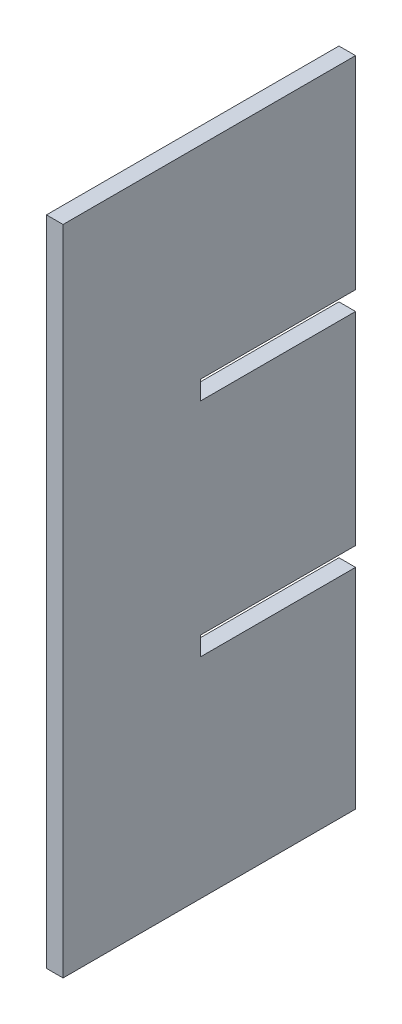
ISO-10303-21;
HEADER;
FILE_DESCRIPTION(('STEP AP214'),'2;1');
FILE_NAME('part.step','',(''),(''),'','','');
FILE_SCHEMA(('AUTOMOTIVE_DESIGN { 1 0 10303 214 1 1 1 1 }'));
ENDSEC;
DATA;
#1=APPLICATION_CONTEXT('core data for automotive mechanical design processes');
#2=APPLICATION_PROTOCOL_DEFINITION('international standard','automotive_design',2000,#1);
#3=PRODUCT_CONTEXT('',#1,'mechanical');
#4=PRODUCT('Part','Part','',(#3));
#5=PRODUCT_RELATED_PRODUCT_CATEGORY('part','',(#4));
#6=PRODUCT_DEFINITION_FORMATION('','',#4);
#7=PRODUCT_DEFINITION_CONTEXT('part definition',#1,'design');
#8=PRODUCT_DEFINITION('design','',#6,#7);
#9=PRODUCT_DEFINITION_SHAPE('','',#8);
#10=(LENGTH_UNIT() NAMED_UNIT(*) SI_UNIT(.MILLI.,.METRE.));
#11=(NAMED_UNIT(*) PLANE_ANGLE_UNIT() SI_UNIT($,.RADIAN.));
#12=(NAMED_UNIT(*) SI_UNIT($,.STERADIAN.) SOLID_ANGLE_UNIT());
#13=UNCERTAINTY_MEASURE_WITH_UNIT(LENGTH_MEASURE(1.E-05),#10,'distance_accuracy_value','');
#14=(GEOMETRIC_REPRESENTATION_CONTEXT(3) GLOBAL_UNCERTAINTY_ASSIGNED_CONTEXT((#13)) GLOBAL_UNIT_ASSIGNED_CONTEXT((#10,
#11,#12)) REPRESENTATION_CONTEXT('',''));
#15=CARTESIAN_POINT('',(0.,0.,0.));
#16=DIRECTION('',(0.,0.,1.));
#17=DIRECTION('',(1.,0.,0.));
#18=AXIS2_PLACEMENT_3D('',#15,#16,#17);
#19=CARTESIAN_POINT('',(0.,0.,0.));
#20=DIRECTION('',(0.,0.,-1.));
#21=DIRECTION('',(-1.,0.,0.));
#22=AXIS2_PLACEMENT_3D('',#19,#20,#21);
#23=PLANE('',#22);
#24=DIRECTION('',(1.,0.,0.));
#25=VECTOR('',#24,1.);
#26=CARTESIAN_POINT('',(-32.352836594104,19.15,0.));
#27=LINE('',#26,#25);
#28=CARTESIAN_POINT('',(-18.25,19.15,0.));
#29=VERTEX_POINT('',#28);
#30=CARTESIAN_POINT('',(-16.75,19.15,0.));
#31=VERTEX_POINT('',#30);
#32=EDGE_CURVE('E135',#29,#31,#27,.T.);
#33=ORIENTED_EDGE('',*,*,#32,.T.);
#34=DIRECTION('',(0.,1.,0.));
#35=VECTOR('',#34,1.);
#36=CARTESIAN_POINT('',(-16.75,-39.75,0.));
#37=LINE('',#36,#35);
#38=CARTESIAN_POINT('',(-16.75,0.849999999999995,0.));
#39=VERTEX_POINT('',#38);
#40=EDGE_CURVE('E132',#39,#31,#37,.T.);
#41=ORIENTED_EDGE('',*,*,#40,.F.);
#42=DIRECTION('',(1.,0.,0.));
#43=VECTOR('',#42,1.);
#44=CARTESIAN_POINT('',(-32.352836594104,0.849999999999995,0.));
#45=LINE('',#44,#43);
#46=CARTESIAN_POINT('',(-18.25,0.849999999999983,0.));
#47=VERTEX_POINT('',#46);
#48=EDGE_CURVE('E189',#47,#39,#45,.T.);
#49=ORIENTED_EDGE('',*,*,#48,.F.);
#50=DIRECTION('',(0.,-1.,0.));
#51=VECTOR('',#50,1.);
#52=CARTESIAN_POINT('',(-18.25,-39.75,0.));
#53=LINE('',#52,#51);
#54=EDGE_CURVE('E47',#29,#47,#53,.T.);
#55=ORIENTED_EDGE('',*,*,#54,.F.);
#56=EDGE_LOOP('',(#33,#41,#49,#55));
#57=FACE_BOUND('',#56,.T.);
#58=ADVANCED_FACE('F32',(#57),#23,.T.);
#59=DIRECTION('',(1.,0.,0.));
#60=VECTOR('',#59,1.);
#61=CARTESIAN_POINT('',(-32.352836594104,-0.850000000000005,0.));
#62=LINE('',#61,#60);
#63=CARTESIAN_POINT('',(-18.25,-0.850000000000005,0.));
#64=VERTEX_POINT('',#63);
#65=CARTESIAN_POINT('',(-16.75,-0.850000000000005,0.));
#66=VERTEX_POINT('',#65);
#67=EDGE_CURVE('E176',#64,#66,#62,.T.);
#68=ORIENTED_EDGE('',*,*,#67,.T.);
#69=CARTESIAN_POINT('',(-16.75,-19.15,0.));
#70=VERTEX_POINT('',#69);
#71=EDGE_CURVE('E159',#70,#66,#37,.T.);
#72=ORIENTED_EDGE('',*,*,#71,.F.);
#73=DIRECTION('',(1.,0.,0.));
#74=VECTOR('',#73,1.);
#75=CARTESIAN_POINT('',(-32.352836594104,-19.15,0.));
#76=LINE('',#75,#74);
#77=CARTESIAN_POINT('',(-18.25,-19.15,0.));
#78=VERTEX_POINT('',#77);
#79=EDGE_CURVE('E175',#78,#70,#76,.T.);
#80=ORIENTED_EDGE('',*,*,#79,.F.);
#81=EDGE_CURVE('E54',#64,#78,#53,.T.);
#82=ORIENTED_EDGE('',*,*,#81,.F.);
#83=EDGE_LOOP('',(#68,#72,#80,#82));
#84=FACE_BOUND('',#83,.T.);
#85=ADVANCED_FACE('F174',(#84),#23,.T.);
#86=DIRECTION('',(1.,0.,0.));
#87=VECTOR('',#86,1.);
#88=CARTESIAN_POINT('',(-32.352836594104,-20.85,0.));
#89=LINE('',#88,#87);
#90=CARTESIAN_POINT('',(-18.25,-20.85,0.));
#91=VERTEX_POINT('',#90);
#92=CARTESIAN_POINT('',(-16.75,-20.85,0.));
#93=VERTEX_POINT('',#92);
#94=EDGE_CURVE('E196',#91,#93,#89,.T.);
#95=ORIENTED_EDGE('',*,*,#94,.T.);
#96=CARTESIAN_POINT('',(-16.75,-39.75,0.));
#97=VERTEX_POINT('',#96);
#98=EDGE_CURVE('E157',#97,#93,#37,.T.);
#99=ORIENTED_EDGE('',*,*,#98,.F.);
#100=DIRECTION('',(1.,0.,0.));
#101=VECTOR('',#100,1.);
#102=CARTESIAN_POINT('',(-18.25,-39.75,0.));
#103=LINE('',#102,#101);
#104=CARTESIAN_POINT('',(-18.25,-39.75,0.));
#105=VERTEX_POINT('',#104);
#106=EDGE_CURVE('E154',#105,#97,#103,.T.);
#107=ORIENTED_EDGE('',*,*,#106,.F.);
#108=EDGE_CURVE('E155',#91,#105,#53,.T.);
#109=ORIENTED_EDGE('',*,*,#108,.F.);
#110=EDGE_LOOP('',(#95,#99,#107,#109));
#111=FACE_BOUND('',#110,.T.);
#112=ADVANCED_FACE('F220',(#111),#23,.T.);
#113=CARTESIAN_POINT('',(-18.25,-39.75,26.4));
#114=DIRECTION('',(1.,0.,0.));
#115=DIRECTION('',(0.,0.,-1.));
#116=AXIS2_PLACEMENT_3D('',#113,#114,#115);
#117=PLANE('',#116);
#118=DIRECTION('',(0.,-1.,0.));
#119=VECTOR('',#118,1.);
#120=CARTESIAN_POINT('',(-18.25,-39.75,26.4));
#121=LINE('',#120,#119);
#122=CARTESIAN_POINT('',(-18.25,19.15,26.4));
#123=VERTEX_POINT('',#122);
#124=CARTESIAN_POINT('',(-18.25,-39.75,26.4));
#125=VERTEX_POINT('',#124);
#126=EDGE_CURVE('E149',#123,#125,#121,.T.);
#127=ORIENTED_EDGE('',*,*,#126,.F.);
#128=DIRECTION('',(0.,0.,1.));
#129=VECTOR('',#128,1.);
#130=CARTESIAN_POINT('',(-18.25,19.15,0.));
#131=LINE('',#130,#129);
#132=EDGE_CURVE('E140',#29,#123,#131,.T.);
#133=ORIENTED_EDGE('',*,*,#132,.F.);
#134=ORIENTED_EDGE('',*,*,#54,.T.);
#135=DIRECTION('',(0.,0.,-1.));
#136=VECTOR('',#135,1.);
#137=CARTESIAN_POINT('',(-18.25,0.849999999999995,0.));
#138=LINE('',#137,#136);
#139=CARTESIAN_POINT('',(-18.25,0.849999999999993,14.));
#140=VERTEX_POINT('',#139);
#141=EDGE_CURVE('E191',#140,#47,#138,.T.);
#142=ORIENTED_EDGE('',*,*,#141,.F.);
#143=DIRECTION('',(0.,1.,0.));
#144=VECTOR('',#143,1.);
#145=CARTESIAN_POINT('',(-18.25,-0.850000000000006,14.));
#146=LINE('',#145,#144);
#147=CARTESIAN_POINT('',(-18.25,-0.850000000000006,14.));
#148=VERTEX_POINT('',#147);
#149=EDGE_CURVE('E178',#148,#140,#146,.T.);
#150=ORIENTED_EDGE('',*,*,#149,.F.);
#151=DIRECTION('',(0.,0.,1.));
#152=VECTOR('',#151,1.);
#153=CARTESIAN_POINT('',(-18.25,-0.850000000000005,0.));
#154=LINE('',#153,#152);
#155=EDGE_CURVE('E181',#64,#148,#154,.T.);
#156=ORIENTED_EDGE('',*,*,#155,.F.);
#157=ORIENTED_EDGE('',*,*,#81,.T.);
#158=DIRECTION('',(0.,0.,-1.));
#159=VECTOR('',#158,1.);
#160=CARTESIAN_POINT('',(-18.25,-19.15,0.));
#161=LINE('',#160,#159);
#162=CARTESIAN_POINT('',(-18.25,-19.15,14.));
#163=VERTEX_POINT('',#162);
#164=EDGE_CURVE('E198',#163,#78,#161,.T.);
#165=ORIENTED_EDGE('',*,*,#164,.F.);
#166=DIRECTION('',(0.,1.,0.));
#167=VECTOR('',#166,1.);
#168=CARTESIAN_POINT('',(-18.25,-20.85,14.));
#169=LINE('',#168,#167);
#170=CARTESIAN_POINT('',(-18.25,-20.85,14.));
#171=VERTEX_POINT('',#170);
#172=EDGE_CURVE('E193',#171,#163,#169,.T.);
#173=ORIENTED_EDGE('',*,*,#172,.F.);
#174=DIRECTION('',(0.,0.,1.));
#175=VECTOR('',#174,1.);
#176=CARTESIAN_POINT('',(-18.25,-20.85,0.));
#177=LINE('',#176,#175);
#178=EDGE_CURVE('E195',#91,#171,#177,.T.);
#179=ORIENTED_EDGE('',*,*,#178,.F.);
#180=ORIENTED_EDGE('',*,*,#108,.T.);
#181=DIRECTION('',(0.,0.,-1.));
#182=VECTOR('',#181,1.);
#183=CARTESIAN_POINT('',(-18.25,-39.75,26.4));
#184=LINE('',#183,#182);
#185=EDGE_CURVE('E11',#125,#105,#184,.T.);
#186=ORIENTED_EDGE('',*,*,#185,.F.);
#187=EDGE_LOOP('',(#127,#133,#134,#142,#150,#156,#157,#165,#173,#179,#180,#186));
#188=FACE_BOUND('',#187,.T.);
#189=ADVANCED_FACE('F34',(#188),#117,.F.);
#190=CARTESIAN_POINT('',(-18.25,-39.75,26.4));
#191=DIRECTION('',(0.,1.,0.));
#192=DIRECTION('',(0.,0.,1.));
#193=AXIS2_PLACEMENT_3D('',#190,#191,#192);
#194=PLANE('',#193);
#195=ORIENTED_EDGE('',*,*,#106,.T.);
#196=DIRECTION('',(0.,0.,-1.));
#197=VECTOR('',#196,1.);
#198=CARTESIAN_POINT('',(-16.75,-39.75,26.4));
#199=LINE('',#198,#197);
#200=CARTESIAN_POINT('',(-16.75,-39.75,26.4));
#201=VERTEX_POINT('',#200);
#202=EDGE_CURVE('E40',#201,#97,#199,.T.);
#203=ORIENTED_EDGE('',*,*,#202,.F.);
#204=DIRECTION('',(1.,0.,0.));
#205=VECTOR('',#204,1.);
#206=CARTESIAN_POINT('',(-18.25,-39.75,26.4));
#207=LINE('',#206,#205);
#208=EDGE_CURVE('E146',#125,#201,#207,.T.);
#209=ORIENTED_EDGE('',*,*,#208,.F.);
#210=ORIENTED_EDGE('',*,*,#185,.T.);
#211=EDGE_LOOP('',(#195,#203,#209,#210));
#212=FACE_BOUND('',#211,.T.);
#213=ADVANCED_FACE('F222',(#212),#194,.F.);
#214=CARTESIAN_POINT('',(-16.75,-39.75,26.4));
#215=DIRECTION('',(-1.,0.,0.));
#216=DIRECTION('',(0.,0.,1.));
#217=AXIS2_PLACEMENT_3D('',#214,#215,#216);
#218=PLANE('',#217);
#219=DIRECTION('',(0.,0.,-1.));
#220=VECTOR('',#219,1.);
#221=CARTESIAN_POINT('',(-16.75,19.15,0.));
#222=LINE('',#221,#220);
#223=CARTESIAN_POINT('',(-16.75,19.15,26.4));
#224=VERTEX_POINT('',#223);
#225=EDGE_CURVE('E124',#224,#31,#222,.T.);
#226=ORIENTED_EDGE('',*,*,#225,.F.);
#227=DIRECTION('',(0.,1.,0.));
#228=VECTOR('',#227,1.);
#229=CARTESIAN_POINT('',(-16.75,-39.75,26.4));
#230=LINE('',#229,#228);
#231=EDGE_CURVE('E129',#201,#224,#230,.T.);
#232=ORIENTED_EDGE('',*,*,#231,.F.);
#233=ORIENTED_EDGE('',*,*,#202,.T.);
#234=ORIENTED_EDGE('',*,*,#98,.T.);
#235=DIRECTION('',(0.,0.,-1.));
#236=VECTOR('',#235,1.);
#237=CARTESIAN_POINT('',(-16.75,-20.85,0.));
#238=LINE('',#237,#236);
#239=CARTESIAN_POINT('',(-16.75,-20.85,14.));
#240=VERTEX_POINT('',#239);
#241=EDGE_CURVE('E203',#240,#93,#238,.T.);
#242=ORIENTED_EDGE('',*,*,#241,.F.);
#243=DIRECTION('',(0.,-1.,0.));
#244=VECTOR('',#243,1.);
#245=CARTESIAN_POINT('',(-16.75,-20.85,14.));
#246=LINE('',#245,#244);
#247=CARTESIAN_POINT('',(-16.75,-19.15,14.));
#248=VERTEX_POINT('',#247);
#249=EDGE_CURVE('E200',#248,#240,#246,.T.);
#250=ORIENTED_EDGE('',*,*,#249,.F.);
#251=DIRECTION('',(0.,0.,1.));
#252=VECTOR('',#251,1.);
#253=CARTESIAN_POINT('',(-16.75,-19.15,0.));
#254=LINE('',#253,#252);
#255=EDGE_CURVE('E170',#70,#248,#254,.T.);
#256=ORIENTED_EDGE('',*,*,#255,.F.);
#257=ORIENTED_EDGE('',*,*,#71,.T.);
#258=DIRECTION('',(0.,0.,-1.));
#259=VECTOR('',#258,1.);
#260=CARTESIAN_POINT('',(-16.75,-0.850000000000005,0.));
#261=LINE('',#260,#259);
#262=CARTESIAN_POINT('',(-16.75,-0.850000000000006,14.));
#263=VERTEX_POINT('',#262);
#264=EDGE_CURVE('E167',#263,#66,#261,.T.);
#265=ORIENTED_EDGE('',*,*,#264,.F.);
#266=DIRECTION('',(0.,-1.,0.));
#267=VECTOR('',#266,1.);
#268=CARTESIAN_POINT('',(-16.75,-0.850000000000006,14.));
#269=LINE('',#268,#267);
#270=CARTESIAN_POINT('',(-16.75,0.849999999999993,14.));
#271=VERTEX_POINT('',#270);
#272=EDGE_CURVE('E351',#271,#263,#269,.T.);
#273=ORIENTED_EDGE('',*,*,#272,.F.);
#274=DIRECTION('',(0.,0.,1.));
#275=VECTOR('',#274,1.);
#276=CARTESIAN_POINT('',(-16.75,0.849999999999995,0.));
#277=LINE('',#276,#275);
#278=EDGE_CURVE('E355',#39,#271,#277,.T.);
#279=ORIENTED_EDGE('',*,*,#278,.F.);
#280=ORIENTED_EDGE('',*,*,#40,.T.);
#281=EDGE_LOOP('',(#226,#232,#233,#234,#242,#250,#256,#257,#265,#273,#279,#280));
#282=FACE_BOUND('',#281,.T.);
#283=ADVANCED_FACE('F126',(#282),#218,.F.);
#284=CARTESIAN_POINT('',(0.,0.,26.4));
#285=DIRECTION('',(0.,0.,-1.));
#286=DIRECTION('',(-1.,0.,0.));
#287=AXIS2_PLACEMENT_3D('',#284,#285,#286);
#288=PLANE('',#287);
#289=ORIENTED_EDGE('',*,*,#231,.T.);
#290=DIRECTION('',(1.,0.,0.));
#291=VECTOR('',#290,1.);
#292=CARTESIAN_POINT('',(-51.7361165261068,19.15,26.4));
#293=LINE('',#292,#291);
#294=EDGE_CURVE('E136',#123,#224,#293,.T.);
#295=ORIENTED_EDGE('',*,*,#294,.F.);
#296=ORIENTED_EDGE('',*,*,#126,.T.);
#297=ORIENTED_EDGE('',*,*,#208,.T.);
#298=EDGE_LOOP('',(#289,#295,#296,#297));
#299=FACE_BOUND('',#298,.T.);
#300=ADVANCED_FACE('F144',(#299),#288,.F.);
#301=CARTESIAN_POINT('',(-32.352836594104,-20.85,0.));
#302=DIRECTION('',(0.,-1.,0.));
#303=DIRECTION('',(0.,0.,-1.));
#304=AXIS2_PLACEMENT_3D('',#301,#302,#303);
#305=PLANE('',#304);
#306=ORIENTED_EDGE('',*,*,#178,.T.);
#307=DIRECTION('',(1.,0.,0.));
#308=VECTOR('',#307,1.);
#309=CARTESIAN_POINT('',(-32.352836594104,-20.85,14.));
#310=LINE('',#309,#308);
#311=EDGE_CURVE('E207',#171,#240,#310,.T.);
#312=ORIENTED_EDGE('',*,*,#311,.T.);
#313=ORIENTED_EDGE('',*,*,#241,.T.);
#314=ORIENTED_EDGE('',*,*,#94,.F.);
#315=EDGE_LOOP('',(#306,#312,#313,#314));
#316=FACE_BOUND('',#315,.T.);
#317=ADVANCED_FACE('F268',(#316),#305,.F.);
#318=CARTESIAN_POINT('',(-32.352836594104,-20.85,14.));
#319=DIRECTION('',(0.,0.,1.));
#320=DIRECTION('',(1.,0.,0.));
#321=AXIS2_PLACEMENT_3D('',#318,#319,#320);
#322=PLANE('',#321);
#323=ORIENTED_EDGE('',*,*,#172,.T.);
#324=DIRECTION('',(1.,0.,0.));
#325=VECTOR('',#324,1.);
#326=CARTESIAN_POINT('',(-32.352836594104,-19.15,14.));
#327=LINE('',#326,#325);
#328=EDGE_CURVE('E209',#163,#248,#327,.T.);
#329=ORIENTED_EDGE('',*,*,#328,.T.);
#330=ORIENTED_EDGE('',*,*,#249,.T.);
#331=ORIENTED_EDGE('',*,*,#311,.F.);
#332=EDGE_LOOP('',(#323,#329,#330,#331));
#333=FACE_BOUND('',#332,.T.);
#334=ADVANCED_FACE('F303',(#333),#322,.F.);
#335=CARTESIAN_POINT('',(-32.352836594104,-19.15,0.));
#336=DIRECTION('',(0.,1.,0.));
#337=DIRECTION('',(0.,0.,1.));
#338=AXIS2_PLACEMENT_3D('',#335,#336,#337);
#339=PLANE('',#338);
#340=ORIENTED_EDGE('',*,*,#164,.T.);
#341=ORIENTED_EDGE('',*,*,#79,.T.);
#342=ORIENTED_EDGE('',*,*,#255,.T.);
#343=ORIENTED_EDGE('',*,*,#328,.F.);
#344=EDGE_LOOP('',(#340,#341,#342,#343));
#345=FACE_BOUND('',#344,.T.);
#346=ADVANCED_FACE('F296',(#345),#339,.F.);
#347=CARTESIAN_POINT('',(-32.352836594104,-0.850000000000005,0.));
#348=DIRECTION('',(0.,-1.,0.));
#349=DIRECTION('',(0.,0.,-1.));
#350=AXIS2_PLACEMENT_3D('',#347,#348,#349);
#351=PLANE('',#350);
#352=ORIENTED_EDGE('',*,*,#155,.T.);
#353=DIRECTION('',(1.,0.,0.));
#354=VECTOR('',#353,1.);
#355=CARTESIAN_POINT('',(-32.352836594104,-0.850000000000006,14.));
#356=LINE('',#355,#354);
#357=EDGE_CURVE('E179',#148,#263,#356,.T.);
#358=ORIENTED_EDGE('',*,*,#357,.T.);
#359=ORIENTED_EDGE('',*,*,#264,.T.);
#360=ORIENTED_EDGE('',*,*,#67,.F.);
#361=EDGE_LOOP('',(#352,#358,#359,#360));
#362=FACE_BOUND('',#361,.T.);
#363=ADVANCED_FACE('F288',(#362),#351,.F.);
#364=CARTESIAN_POINT('',(-32.352836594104,-0.850000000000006,14.));
#365=DIRECTION('',(0.,0.,1.));
#366=DIRECTION('',(1.,0.,0.));
#367=AXIS2_PLACEMENT_3D('',#364,#365,#366);
#368=PLANE('',#367);
#369=ORIENTED_EDGE('',*,*,#149,.T.);
#370=DIRECTION('',(1.,0.,0.));
#371=VECTOR('',#370,1.);
#372=CARTESIAN_POINT('',(-32.352836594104,0.849999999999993,14.));
#373=LINE('',#372,#371);
#374=EDGE_CURVE('E183',#140,#271,#373,.T.);
#375=ORIENTED_EDGE('',*,*,#374,.T.);
#376=ORIENTED_EDGE('',*,*,#272,.T.);
#377=ORIENTED_EDGE('',*,*,#357,.F.);
#378=EDGE_LOOP('',(#369,#375,#376,#377));
#379=FACE_BOUND('',#378,.T.);
#380=ADVANCED_FACE('F283',(#379),#368,.F.);
#381=CARTESIAN_POINT('',(-32.352836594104,0.849999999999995,0.));
#382=DIRECTION('',(0.,1.,0.));
#383=DIRECTION('',(0.,0.,1.));
#384=AXIS2_PLACEMENT_3D('',#381,#382,#383);
#385=PLANE('',#384);
#386=ORIENTED_EDGE('',*,*,#141,.T.);
#387=ORIENTED_EDGE('',*,*,#48,.T.);
#388=ORIENTED_EDGE('',*,*,#278,.T.);
#389=ORIENTED_EDGE('',*,*,#374,.F.);
#390=EDGE_LOOP('',(#386,#387,#388,#389));
#391=FACE_BOUND('',#390,.T.);
#392=ADVANCED_FACE('F253',(#391),#385,.F.);
#393=CARTESIAN_POINT('',(-32.352836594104,19.15,0.));
#394=DIRECTION('',(0.,-1.,0.));
#395=DIRECTION('',(0.,0.,-1.));
#396=AXIS2_PLACEMENT_3D('',#393,#394,#395);
#397=PLANE('',#396);
#398=ORIENTED_EDGE('',*,*,#132,.T.);
#399=ORIENTED_EDGE('',*,*,#294,.T.);
#400=ORIENTED_EDGE('',*,*,#225,.T.);
#401=ORIENTED_EDGE('',*,*,#32,.F.);
#402=EDGE_LOOP('',(#398,#399,#400,#401));
#403=FACE_BOUND('',#402,.T.);
#404=ADVANCED_FACE('F139',(#403),#397,.F.);
#405=CLOSED_SHELL('',(#58,#85,#112,#189,#213,#283,#300,#317,#334,#346,#363,#380,#392,#404));
#406=MANIFOLD_SOLID_BREP('B2',#405);
#407=ADVANCED_BREP_SHAPE_REPRESENTATION('',(#18,#406),#14);
#408=SHAPE_DEFINITION_REPRESENTATION(#9,#407);
ENDSEC;
END-ISO-10303-21;
